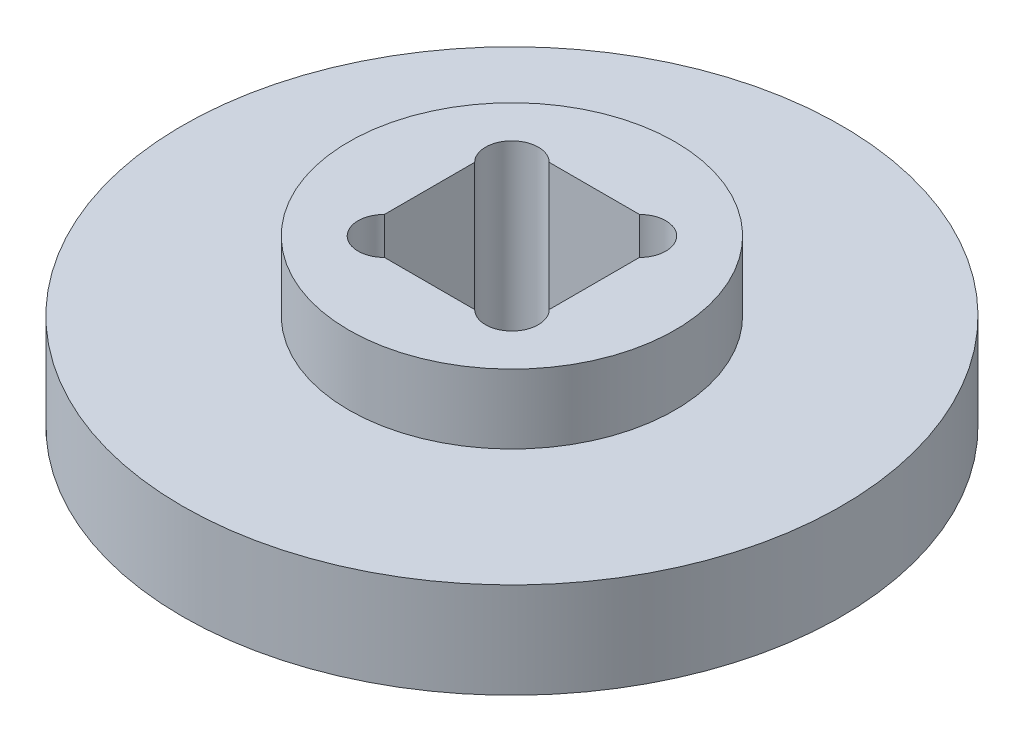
ISO-10303-21;
HEADER;
FILE_DESCRIPTION(('STEP AP214'),'2;1');
FILE_NAME('part.step','',(''),(''),'','','');
FILE_SCHEMA(('AUTOMOTIVE_DESIGN { 1 0 10303 214 1 1 1 1 }'));
ENDSEC;
DATA;
#1=APPLICATION_CONTEXT('core data for automotive mechanical design processes');
#2=APPLICATION_PROTOCOL_DEFINITION('international standard','automotive_design',2000,#1);
#3=PRODUCT_CONTEXT('',#1,'mechanical');
#4=PRODUCT('Part','Part','',(#3));
#5=PRODUCT_RELATED_PRODUCT_CATEGORY('part','',(#4));
#6=PRODUCT_DEFINITION_FORMATION('','',#4);
#7=PRODUCT_DEFINITION_CONTEXT('part definition',#1,'design');
#8=PRODUCT_DEFINITION('design','',#6,#7);
#9=PRODUCT_DEFINITION_SHAPE('','',#8);
#10=(LENGTH_UNIT() NAMED_UNIT(*) SI_UNIT(.MILLI.,.METRE.));
#11=(NAMED_UNIT(*) PLANE_ANGLE_UNIT() SI_UNIT($,.RADIAN.));
#12=(NAMED_UNIT(*) SI_UNIT($,.STERADIAN.) SOLID_ANGLE_UNIT());
#13=UNCERTAINTY_MEASURE_WITH_UNIT(LENGTH_MEASURE(1.E-05),#10,'distance_accuracy_value','');
#14=(GEOMETRIC_REPRESENTATION_CONTEXT(3) GLOBAL_UNCERTAINTY_ASSIGNED_CONTEXT((#13)) GLOBAL_UNIT_ASSIGNED_CONTEXT((#10,
#11,#12)) REPRESENTATION_CONTEXT('',''));
#15=CARTESIAN_POINT('',(0.,0.,0.));
#16=DIRECTION('',(0.,0.,1.));
#17=DIRECTION('',(1.,0.,0.));
#18=AXIS2_PLACEMENT_3D('',#15,#16,#17);
#19=CARTESIAN_POINT('',(0.,5.8,0.));
#20=DIRECTION('',(0.,1.,0.));
#21=DIRECTION('',(0.,0.,1.));
#22=AXIS2_PLACEMENT_3D('',#19,#20,#21);
#23=PLANE('',#22);
#24=CARTESIAN_POINT('',(0.,5.8,0.));
#25=DIRECTION('',(0.,1.,0.));
#26=DIRECTION('',(0.,0.,1.));
#27=AXIS2_PLACEMENT_3D('',#24,#25,#26);
#28=CIRCLE('',#27,20.);
#29=CARTESIAN_POINT('',(0.,5.8,20.));
#30=VERTEX_POINT('',#29);
#31=EDGE_CURVE('E11',#30,#30,#28,.T.);
#32=ORIENTED_EDGE('',*,*,#31,.T.);
#33=EDGE_LOOP('',(#32));
#34=FACE_BOUND('',#33,.T.);
#35=CARTESIAN_POINT('',(0.,5.8,0.));
#36=DIRECTION('',(0.,1.,0.));
#37=DIRECTION('',(0.,0.,1.));
#38=AXIS2_PLACEMENT_3D('',#35,#36,#37);
#39=CIRCLE('',#38,9.9);
#40=CARTESIAN_POINT('',(0.,5.8,9.9));
#41=VERTEX_POINT('',#40);
#42=EDGE_CURVE('E154',#41,#41,#39,.T.);
#43=ORIENTED_EDGE('',*,*,#42,.F.);
#44=EDGE_LOOP('',(#43));
#45=FACE_BOUND('',#44,.T.);
#46=ADVANCED_FACE('F32',(#34,#45),#23,.T.);
#47=CARTESIAN_POINT('',(0.,5.8,0.));
#48=DIRECTION('',(0.,-1.,0.));
#49=DIRECTION('',(0.,0.,-1.));
#50=AXIS2_PLACEMENT_3D('',#47,#48,#49);
#51=CYLINDRICAL_SURFACE('',#50,20.);
#52=ORIENTED_EDGE('',*,*,#31,.F.);
#53=EDGE_LOOP('',(#52));
#54=FACE_BOUND('',#53,.T.);
#55=CARTESIAN_POINT('',(0.,0.,0.));
#56=DIRECTION('',(0.,1.,0.));
#57=DIRECTION('',(0.,0.,1.));
#58=AXIS2_PLACEMENT_3D('',#55,#56,#57);
#59=CIRCLE('',#58,20.);
#60=CARTESIAN_POINT('',(0.,0.,20.));
#61=VERTEX_POINT('',#60);
#62=EDGE_CURVE('E36',#61,#61,#59,.T.);
#63=ORIENTED_EDGE('',*,*,#62,.T.);
#64=EDGE_LOOP('',(#63));
#65=FACE_BOUND('',#64,.T.);
#66=ADVANCED_FACE('F34',(#54,#65),#51,.T.);
#67=CARTESIAN_POINT('',(0.,0.,0.));
#68=DIRECTION('',(0.,1.,0.));
#69=DIRECTION('',(0.,0.,1.));
#70=AXIS2_PLACEMENT_3D('',#67,#68,#69);
#71=PLANE('',#70);
#72=DIRECTION('',(-1.,0.,0.));
#73=VECTOR('',#72,1.);
#74=CARTESIAN_POINT('',(-2.73725830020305,0.,-5.));
#75=LINE('',#74,#73);
#76=CARTESIAN_POINT('',(2.73725830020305,0.,-5.));
#77=VERTEX_POINT('',#76);
#78=CARTESIAN_POINT('',(-2.73725830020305,0.,-5.));
#79=VERTEX_POINT('',#78);
#80=EDGE_CURVE('E105',#77,#79,#75,.T.);
#81=ORIENTED_EDGE('',*,*,#80,.T.);
#82=CARTESIAN_POINT('',(-3.86862915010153,0.,-3.86862915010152));
#83=DIRECTION('',(0.,1.,0.));
#84=DIRECTION('',(0.,0.,1.));
#85=AXIS2_PLACEMENT_3D('',#82,#83,#84);
#86=CIRCLE('',#85,1.6);
#87=CARTESIAN_POINT('',(-5.,0.,-2.73725830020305));
#88=VERTEX_POINT('',#87);
#89=EDGE_CURVE('E99',#79,#88,#86,.T.);
#90=ORIENTED_EDGE('',*,*,#89,.T.);
#91=DIRECTION('',(0.,0.,1.));
#92=VECTOR('',#91,1.);
#93=CARTESIAN_POINT('',(-5.,0.,-2.73725830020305));
#94=LINE('',#93,#92);
#95=CARTESIAN_POINT('',(-5.,0.,2.73725830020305));
#96=VERTEX_POINT('',#95);
#97=EDGE_CURVE('E108',#88,#96,#94,.T.);
#98=ORIENTED_EDGE('',*,*,#97,.T.);
#99=CARTESIAN_POINT('',(-3.86862915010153,0.,3.86862915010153));
#100=DIRECTION('',(0.,1.,0.));
#101=DIRECTION('',(0.,0.,-1.));
#102=AXIS2_PLACEMENT_3D('',#99,#100,#101);
#103=CIRCLE('',#102,1.6);
#104=CARTESIAN_POINT('',(-2.73725830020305,0.,5.));
#105=VERTEX_POINT('',#104);
#106=EDGE_CURVE('E47',#96,#105,#103,.T.);
#107=ORIENTED_EDGE('',*,*,#106,.T.);
#108=DIRECTION('',(1.,0.,0.));
#109=VECTOR('',#108,1.);
#110=CARTESIAN_POINT('',(-2.73725830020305,0.,5.));
#111=LINE('',#110,#109);
#112=CARTESIAN_POINT('',(2.73725830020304,0.,5.));
#113=VERTEX_POINT('',#112);
#114=EDGE_CURVE('E123',#105,#113,#111,.T.);
#115=ORIENTED_EDGE('',*,*,#114,.T.);
#116=CARTESIAN_POINT('',(3.86862915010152,0.,3.86862915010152));
#117=DIRECTION('',(0.,1.,0.));
#118=DIRECTION('',(0.,0.,1.));
#119=AXIS2_PLACEMENT_3D('',#116,#117,#118);
#120=CIRCLE('',#119,1.6);
#121=CARTESIAN_POINT('',(4.99999999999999,0.,2.73725830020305));
#122=VERTEX_POINT('',#121);
#123=EDGE_CURVE('E126',#113,#122,#120,.T.);
#124=ORIENTED_EDGE('',*,*,#123,.T.);
#125=DIRECTION('',(0.,0.,-1.));
#126=VECTOR('',#125,1.);
#127=CARTESIAN_POINT('',(5.,0.,-2.73725830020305));
#128=LINE('',#127,#126);
#129=CARTESIAN_POINT('',(5.,0.,-2.73725830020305));
#130=VERTEX_POINT('',#129);
#131=EDGE_CURVE('E129',#122,#130,#128,.T.);
#132=ORIENTED_EDGE('',*,*,#131,.T.);
#133=CARTESIAN_POINT('',(3.86862915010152,0.,-3.86862915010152));
#134=DIRECTION('',(0.,1.,0.));
#135=DIRECTION('',(0.,0.,-1.));
#136=AXIS2_PLACEMENT_3D('',#133,#134,#135);
#137=CIRCLE('',#136,1.6);
#138=EDGE_CURVE('E132',#130,#77,#137,.T.);
#139=ORIENTED_EDGE('',*,*,#138,.T.);
#140=EDGE_LOOP('',(#81,#90,#98,#107,#115,#124,#132,#139));
#141=FACE_BOUND('',#140,.T.);
#142=ORIENTED_EDGE('',*,*,#62,.F.);
#143=EDGE_LOOP('',(#142));
#144=FACE_BOUND('',#143,.T.);
#145=ADVANCED_FACE('F112',(#141,#144),#71,.F.);
#146=CARTESIAN_POINT('',(0.,10.,0.));
#147=DIRECTION('',(0.,-1.,0.));
#148=DIRECTION('',(0.,0.,-1.));
#149=AXIS2_PLACEMENT_3D('',#146,#147,#148);
#150=CYLINDRICAL_SURFACE('',#149,9.9);
#151=CARTESIAN_POINT('',(0.,10.,0.));
#152=DIRECTION('',(0.,1.,0.));
#153=DIRECTION('',(0.,0.,1.));
#154=AXIS2_PLACEMENT_3D('',#151,#152,#153);
#155=CIRCLE('',#154,9.9);
#156=CARTESIAN_POINT('',(0.,10.,9.9));
#157=VERTEX_POINT('',#156);
#158=EDGE_CURVE('E166',#157,#157,#155,.T.);
#159=ORIENTED_EDGE('',*,*,#158,.F.);
#160=EDGE_LOOP('',(#159));
#161=FACE_BOUND('',#160,.T.);
#162=ORIENTED_EDGE('',*,*,#42,.T.);
#163=EDGE_LOOP('',(#162));
#164=FACE_BOUND('',#163,.T.);
#165=ADVANCED_FACE('F172',(#161,#164),#150,.T.);
#166=CARTESIAN_POINT('',(0.,10.,0.));
#167=DIRECTION('',(0.,1.,0.));
#168=DIRECTION('',(0.,0.,1.));
#169=AXIS2_PLACEMENT_3D('',#166,#167,#168);
#170=PLANE('',#169);
#171=CARTESIAN_POINT('',(-3.86862915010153,10.,-3.86862915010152));
#172=DIRECTION('',(0.,1.,0.));
#173=DIRECTION('',(0.,0.,1.));
#174=AXIS2_PLACEMENT_3D('',#171,#172,#173);
#175=CIRCLE('',#174,1.6);
#176=CARTESIAN_POINT('',(-2.73725830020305,10.,-5.));
#177=VERTEX_POINT('',#176);
#178=CARTESIAN_POINT('',(-5.,10.,-2.73725830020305));
#179=VERTEX_POINT('',#178);
#180=EDGE_CURVE('E55',#177,#179,#175,.T.);
#181=ORIENTED_EDGE('',*,*,#180,.F.);
#182=DIRECTION('',(-1.,0.,0.));
#183=VECTOR('',#182,1.);
#184=CARTESIAN_POINT('',(-2.73725830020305,10.,-5.));
#185=LINE('',#184,#183);
#186=CARTESIAN_POINT('',(2.73725830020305,10.,-5.));
#187=VERTEX_POINT('',#186);
#188=EDGE_CURVE('E116',#187,#177,#185,.T.);
#189=ORIENTED_EDGE('',*,*,#188,.F.);
#190=CARTESIAN_POINT('',(3.86862915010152,10.,-3.86862915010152));
#191=DIRECTION('',(0.,1.,0.));
#192=DIRECTION('',(0.,0.,-1.));
#193=AXIS2_PLACEMENT_3D('',#190,#191,#192);
#194=CIRCLE('',#193,1.6);
#195=CARTESIAN_POINT('',(5.,10.,-2.73725830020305));
#196=VERTEX_POINT('',#195);
#197=EDGE_CURVE('E119',#196,#187,#194,.T.);
#198=ORIENTED_EDGE('',*,*,#197,.F.);
#199=DIRECTION('',(0.,0.,-1.));
#200=VECTOR('',#199,1.);
#201=CARTESIAN_POINT('',(5.,10.,-2.73725830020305));
#202=LINE('',#201,#200);
#203=CARTESIAN_POINT('',(4.99999999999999,10.,2.73725830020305));
#204=VERTEX_POINT('',#203);
#205=EDGE_CURVE('E147',#204,#196,#202,.T.);
#206=ORIENTED_EDGE('',*,*,#205,.F.);
#207=CARTESIAN_POINT('',(3.86862915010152,10.,3.86862915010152));
#208=DIRECTION('',(0.,1.,0.));
#209=DIRECTION('',(0.,0.,1.));
#210=AXIS2_PLACEMENT_3D('',#207,#208,#209);
#211=CIRCLE('',#210,1.6);
#212=CARTESIAN_POINT('',(2.73725830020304,10.,5.));
#213=VERTEX_POINT('',#212);
#214=EDGE_CURVE('E144',#213,#204,#211,.T.);
#215=ORIENTED_EDGE('',*,*,#214,.F.);
#216=DIRECTION('',(1.,0.,0.));
#217=VECTOR('',#216,1.);
#218=CARTESIAN_POINT('',(-2.73725830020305,10.,5.));
#219=LINE('',#218,#217);
#220=CARTESIAN_POINT('',(-2.73725830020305,10.,5.));
#221=VERTEX_POINT('',#220);
#222=EDGE_CURVE('E141',#221,#213,#219,.T.);
#223=ORIENTED_EDGE('',*,*,#222,.F.);
#224=CARTESIAN_POINT('',(-3.86862915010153,10.,3.86862915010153));
#225=DIRECTION('',(0.,1.,0.));
#226=DIRECTION('',(0.,0.,-1.));
#227=AXIS2_PLACEMENT_3D('',#224,#225,#226);
#228=CIRCLE('',#227,1.6);
#229=CARTESIAN_POINT('',(-5.,10.,2.73725830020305));
#230=VERTEX_POINT('',#229);
#231=EDGE_CURVE('E138',#230,#221,#228,.T.);
#232=ORIENTED_EDGE('',*,*,#231,.F.);
#233=DIRECTION('',(0.,0.,1.));
#234=VECTOR('',#233,1.);
#235=CARTESIAN_POINT('',(-5.,10.,-2.73725830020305));
#236=LINE('',#235,#234);
#237=EDGE_CURVE('E136',#179,#230,#236,.T.);
#238=ORIENTED_EDGE('',*,*,#237,.F.);
#239=EDGE_LOOP('',(#181,#189,#198,#206,#215,#223,#232,#238));
#240=FACE_BOUND('',#239,.T.);
#241=ORIENTED_EDGE('',*,*,#158,.T.);
#242=EDGE_LOOP('',(#241));
#243=FACE_BOUND('',#242,.T.);
#244=ADVANCED_FACE('F187',(#240,#243),#170,.T.);
#245=CARTESIAN_POINT('',(-3.86862915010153,0.,-3.86862915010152));
#246=DIRECTION('',(0.,1.,0.));
#247=DIRECTION('',(0.,0.,1.));
#248=AXIS2_PLACEMENT_3D('',#245,#246,#247);
#249=CYLINDRICAL_SURFACE('',#248,1.6);
#250=ORIENTED_EDGE('',*,*,#180,.T.);
#251=DIRECTION('',(0.,1.,0.));
#252=VECTOR('',#251,1.);
#253=CARTESIAN_POINT('',(-5.,0.,-2.73725830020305));
#254=LINE('',#253,#252);
#255=EDGE_CURVE('E95',#88,#179,#254,.T.);
#256=ORIENTED_EDGE('',*,*,#255,.F.);
#257=ORIENTED_EDGE('',*,*,#89,.F.);
#258=DIRECTION('',(0.,1.,0.));
#259=VECTOR('',#258,1.);
#260=CARTESIAN_POINT('',(-2.73725830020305,0.,-5.));
#261=LINE('',#260,#259);
#262=EDGE_CURVE('E152',#79,#177,#261,.T.);
#263=ORIENTED_EDGE('',*,*,#262,.T.);
#264=EDGE_LOOP('',(#250,#256,#257,#263));
#265=FACE_BOUND('',#264,.T.);
#266=ADVANCED_FACE('F97',(#265),#249,.F.);
#267=CARTESIAN_POINT('',(-2.73725830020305,0.,-5.));
#268=DIRECTION('',(0.,0.,-1.));
#269=DIRECTION('',(-1.,0.,0.));
#270=AXIS2_PLACEMENT_3D('',#267,#268,#269);
#271=PLANE('',#270);
#272=ORIENTED_EDGE('',*,*,#188,.T.);
#273=ORIENTED_EDGE('',*,*,#262,.F.);
#274=ORIENTED_EDGE('',*,*,#80,.F.);
#275=DIRECTION('',(0.,1.,0.));
#276=VECTOR('',#275,1.);
#277=CARTESIAN_POINT('',(2.73725830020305,0.,-5.));
#278=LINE('',#277,#276);
#279=EDGE_CURVE('E155',#77,#187,#278,.T.);
#280=ORIENTED_EDGE('',*,*,#279,.T.);
#281=EDGE_LOOP('',(#272,#273,#274,#280));
#282=FACE_BOUND('',#281,.T.);
#283=ADVANCED_FACE('F198',(#282),#271,.F.);
#284=CARTESIAN_POINT('',(3.86862915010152,0.,-3.86862915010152));
#285=DIRECTION('',(0.,1.,0.));
#286=DIRECTION('',(0.,0.,1.));
#287=AXIS2_PLACEMENT_3D('',#284,#285,#286);
#288=CYLINDRICAL_SURFACE('',#287,1.6);
#289=ORIENTED_EDGE('',*,*,#197,.T.);
#290=ORIENTED_EDGE('',*,*,#279,.F.);
#291=ORIENTED_EDGE('',*,*,#138,.F.);
#292=DIRECTION('',(0.,1.,0.));
#293=VECTOR('',#292,1.);
#294=CARTESIAN_POINT('',(5.,0.,-2.73725830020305));
#295=LINE('',#294,#293);
#296=EDGE_CURVE('E157',#130,#196,#295,.T.);
#297=ORIENTED_EDGE('',*,*,#296,.T.);
#298=EDGE_LOOP('',(#289,#290,#291,#297));
#299=FACE_BOUND('',#298,.T.);
#300=ADVANCED_FACE('F217',(#299),#288,.F.);
#301=CARTESIAN_POINT('',(5.,0.,-2.73725830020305));
#302=DIRECTION('',(1.,0.,0.));
#303=DIRECTION('',(0.,0.,-1.));
#304=AXIS2_PLACEMENT_3D('',#301,#302,#303);
#305=PLANE('',#304);
#306=ORIENTED_EDGE('',*,*,#205,.T.);
#307=ORIENTED_EDGE('',*,*,#296,.F.);
#308=ORIENTED_EDGE('',*,*,#131,.F.);
#309=DIRECTION('',(0.,1.,0.));
#310=VECTOR('',#309,1.);
#311=CARTESIAN_POINT('',(4.99999999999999,0.,2.73725830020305));
#312=LINE('',#311,#310);
#313=EDGE_CURVE('E159',#122,#204,#312,.T.);
#314=ORIENTED_EDGE('',*,*,#313,.T.);
#315=EDGE_LOOP('',(#306,#307,#308,#314));
#316=FACE_BOUND('',#315,.T.);
#317=ADVANCED_FACE('F213',(#316),#305,.F.);
#318=CARTESIAN_POINT('',(3.86862915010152,0.,3.86862915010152));
#319=DIRECTION('',(0.,1.,0.));
#320=DIRECTION('',(0.,0.,1.));
#321=AXIS2_PLACEMENT_3D('',#318,#319,#320);
#322=CYLINDRICAL_SURFACE('',#321,1.6);
#323=ORIENTED_EDGE('',*,*,#214,.T.);
#324=ORIENTED_EDGE('',*,*,#313,.F.);
#325=ORIENTED_EDGE('',*,*,#123,.F.);
#326=DIRECTION('',(0.,1.,0.));
#327=VECTOR('',#326,1.);
#328=CARTESIAN_POINT('',(2.73725830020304,0.,5.));
#329=LINE('',#328,#327);
#330=EDGE_CURVE('E161',#113,#213,#329,.T.);
#331=ORIENTED_EDGE('',*,*,#330,.T.);
#332=EDGE_LOOP('',(#323,#324,#325,#331));
#333=FACE_BOUND('',#332,.T.);
#334=ADVANCED_FACE('F209',(#333),#322,.F.);
#335=CARTESIAN_POINT('',(-2.73725830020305,0.,5.));
#336=DIRECTION('',(0.,0.,1.));
#337=DIRECTION('',(1.,0.,0.));
#338=AXIS2_PLACEMENT_3D('',#335,#336,#337);
#339=PLANE('',#338);
#340=ORIENTED_EDGE('',*,*,#222,.T.);
#341=ORIENTED_EDGE('',*,*,#330,.F.);
#342=ORIENTED_EDGE('',*,*,#114,.F.);
#343=DIRECTION('',(0.,1.,0.));
#344=VECTOR('',#343,1.);
#345=CARTESIAN_POINT('',(-2.73725830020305,0.,5.));
#346=LINE('',#345,#344);
#347=EDGE_CURVE('E163',#105,#221,#346,.T.);
#348=ORIENTED_EDGE('',*,*,#347,.T.);
#349=EDGE_LOOP('',(#340,#341,#342,#348));
#350=FACE_BOUND('',#349,.T.);
#351=ADVANCED_FACE('F206',(#350),#339,.F.);
#352=CARTESIAN_POINT('',(-3.86862915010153,0.,3.86862915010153));
#353=DIRECTION('',(0.,1.,0.));
#354=DIRECTION('',(0.,0.,1.));
#355=AXIS2_PLACEMENT_3D('',#352,#353,#354);
#356=CYLINDRICAL_SURFACE('',#355,1.6);
#357=ORIENTED_EDGE('',*,*,#231,.T.);
#358=ORIENTED_EDGE('',*,*,#347,.F.);
#359=ORIENTED_EDGE('',*,*,#106,.F.);
#360=DIRECTION('',(0.,1.,0.));
#361=VECTOR('',#360,1.);
#362=CARTESIAN_POINT('',(-5.,0.,2.73725830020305));
#363=LINE('',#362,#361);
#364=EDGE_CURVE('E104',#96,#230,#363,.T.);
#365=ORIENTED_EDGE('',*,*,#364,.T.);
#366=EDGE_LOOP('',(#357,#358,#359,#365));
#367=FACE_BOUND('',#366,.T.);
#368=ADVANCED_FACE('F203',(#367),#356,.F.);
#369=CARTESIAN_POINT('',(-5.,0.,-2.73725830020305));
#370=DIRECTION('',(-1.,0.,0.));
#371=DIRECTION('',(0.,0.,1.));
#372=AXIS2_PLACEMENT_3D('',#369,#370,#371);
#373=PLANE('',#372);
#374=ORIENTED_EDGE('',*,*,#237,.T.);
#375=ORIENTED_EDGE('',*,*,#364,.F.);
#376=ORIENTED_EDGE('',*,*,#97,.F.);
#377=ORIENTED_EDGE('',*,*,#255,.T.);
#378=EDGE_LOOP('',(#374,#375,#376,#377));
#379=FACE_BOUND('',#378,.T.);
#380=ADVANCED_FACE('F109',(#379),#373,.F.);
#381=CLOSED_SHELL('',(#46,#66,#145,#165,#244,#266,#283,#300,#317,#334,#351,#368,#380));
#382=MANIFOLD_SOLID_BREP('B2',#381);
#383=ADVANCED_BREP_SHAPE_REPRESENTATION('',(#18,#382),#14);
#384=SHAPE_DEFINITION_REPRESENTATION(#9,#383);
ENDSEC;
END-ISO-10303-21;
